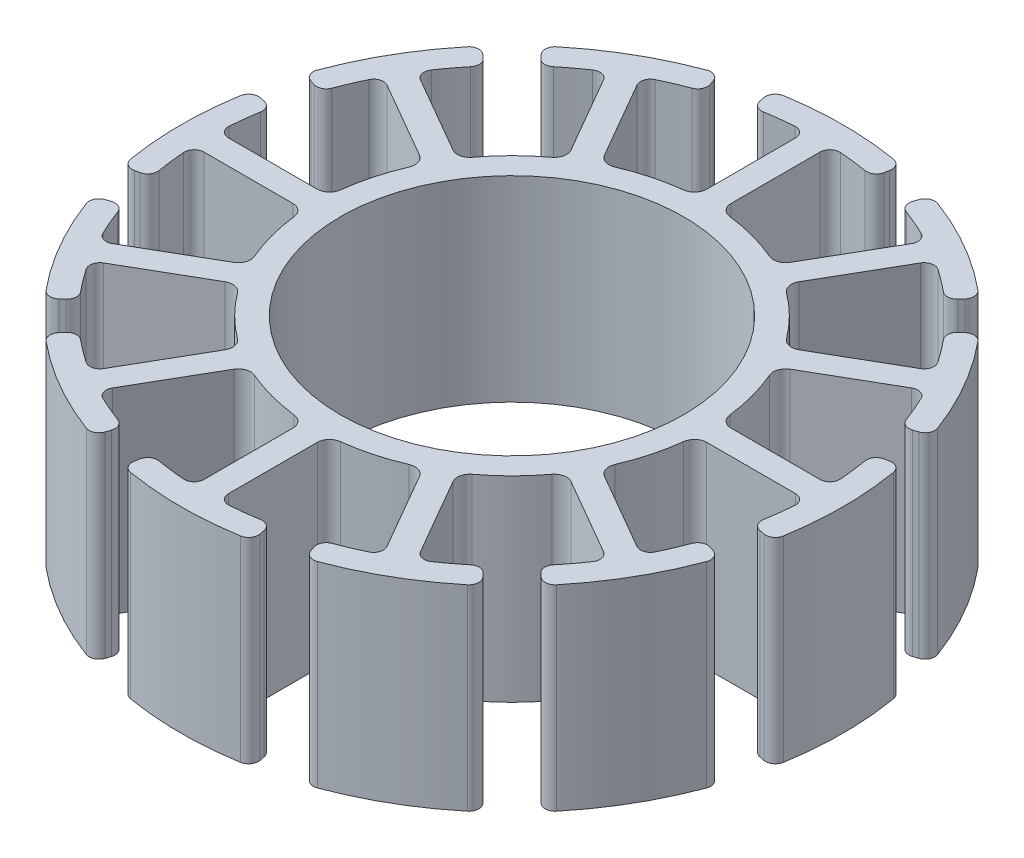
from build123d import *

# Parameters (mm, degrees)
SKETCH1_R           = 8
SKETCH1_R_2         = 7
BOSS_EXTRUDE1_DEPTH = 8
BOSS_EXTRUDE2_DEPTH = 8
CIRPATTERN1_COUNT   = 12
FILLET1_R           = 0.5


with BuildPart() as part:
    # Sketch1 → Boss-Extrude1 (new body)
    with BuildSketch(Plane(origin=(0, 0, 0), x_dir=(1, 0, 0), z_dir=(0, 1, 0))):
        with Locations(Location((0, 0, 0), (0, 0, 270))):
            Circle(SKETCH1_R)
        with Locations(Location((0, 0, 0), (0, 0, 270))):
            Circle(SKETCH1_R_2, mode=Mode.SUBTRACT)
    extrude(amount=BOSS_EXTRUDE1_DEPTH)

    # Sketch2 → Boss-Extrude2 (add)
    with BuildSketch(Plane(origin=(0, 8, 0), x_dir=(1, 0, 0), z_dir=(0, 1, 0))):
        with BuildLine():
            Line((0.5, -7.716962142), (0.5, -12.066482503))
            ThreePointArc((0.5, -12.066482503), (0.627879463, -12.359655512), (0.929752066, -12.465374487))
            ThreePointArc((0.929752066, -12.465374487), (1.501563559, -12.409484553), (2.070202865, -12.327378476))
            ThreePointArc((2.070202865, -12.327378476), (2.363463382, -12.392514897), (2.528681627, -12.643408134))
            Line((2.528681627, -12.643408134), (2.567923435, -12.839617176))
            ThreePointArc((2.567923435, -12.839617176), (2.505084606, -13.144999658), (2.242124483, -13.312508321))
            ThreePointArc((2.242124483, -13.312508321), (0, -13.5), (-2.242124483, -13.312508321))
            ThreePointArc((-2.242124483, -13.312508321), (-2.505084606, -13.144999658), (-2.567923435, -12.839617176))
            Line((-2.567923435, -12.839617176), (-2.528681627, -12.643408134))
            ThreePointArc((-2.528681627, -12.643408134), (-2.363463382, -12.392514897), (-2.070202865, -12.327378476))
            ThreePointArc((-2.070202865, -12.327378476), (-1.501563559, -12.409484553), (-0.929752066, -12.465374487))
            ThreePointArc((-0.929752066, -12.465374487), (-0.627879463, -12.359655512), (-0.5, -12.066482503))
            Line((-0.5, -12.066482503), (-0.5, -7.716962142))
            Line((-0.5, -7.716962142), (0.5, -7.716962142))
        make_face()
    boss_extrude2 = extrude(amount=-BOSS_EXTRUDE2_DEPTH)

    # CirPattern1: Boss-Extrude2 ×12 about axis
    cirpattern1_axis = Axis((0, 0, 0), (0, 1, 0))
    for i in range(1, CIRPATTERN1_COUNT):
        add(boss_extrude2.rotate(cirpattern1_axis, i * 360 / CIRPATTERN1_COUNT))

    # Fillet1
    fillet1_edges = [part.edges().sort_by_distance(p)[0] for p in [
        (0.5, 4, 7.984359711),
        (-0.5, 4, 7.984359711),
        (-7.984359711, 4, -0.5),
        (-7.984359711, 4, 0.5),
        (-6.664658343, 4, -4.425192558),
        (-7.164658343, 4, -3.559167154),
        (-3.559167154, 4, -7.164658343),
        (-4.425192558, 4, -6.664658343),
        (0.5, 4, -7.984359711),
        (-0.5, 4, -7.984359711),
        (4.425192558, 4, -6.664658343),
        (3.559167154, 4, -7.164658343),
        (7.164658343, 4, -3.559167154),
        (6.664658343, 4, -4.425192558),
        (7.984359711, 4, 0.5),
        (7.984359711, 4, -0.5),
        (6.664658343, 4, 4.425192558),
        (7.164658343, 4, 3.559167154),
        (3.559167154, 4, 7.164658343),
        (4.425192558, 4, 6.664658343),
        (-3.559167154, 4, 7.164658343),
        (-4.425192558, 4, 6.664658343),
        (-7.164658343, 4, 3.559167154),
        (-6.664658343, 4, 4.425192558),
    ]]
    fillet(fillet1_edges, radius=FILLET1_R)


solid = part.part
